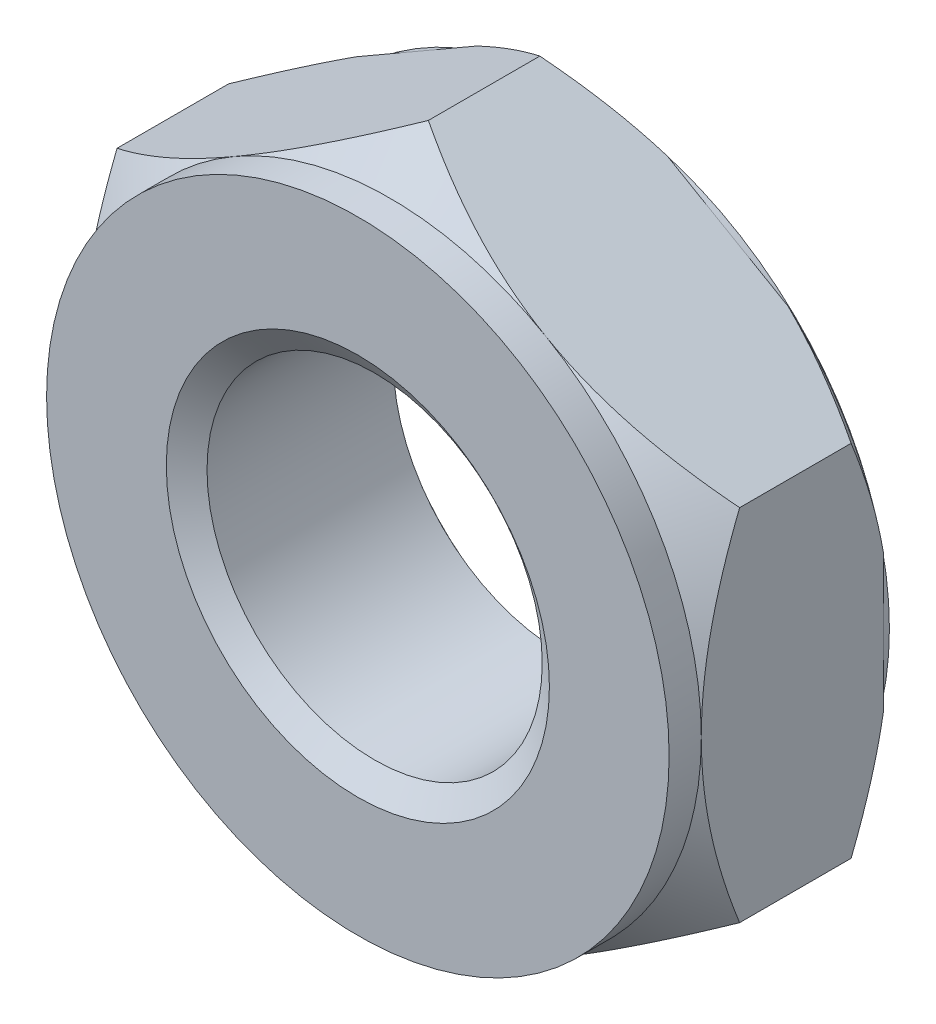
from build123d import *

# Parameters (mm, degrees)
BASENUT_START = -14.605
BASENUTSKE_R  = 11.1125
BASENUT_DEPTH = 14.605
SKETCH4_W     = 0.4064
SKETCH4_H     = 15.892632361


with BuildPart() as part:
    # BaseNutSke → BaseNut (new body)
    with BuildSketch(Plane.XY.offset(BASENUT_START)):
        Polygon((20.6375, 11.91506618), (20.6375, -11.91506618), (0, -23.830132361), (-20.6375, -11.91506618), (-20.6375, 11.91506618), (0, 23.830132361), align=None)
        Circle(BASENUTSKE_R, mode=Mode.SUBTRACT)
    extrude(amount=BASENUT_DEPTH)

    # Sketch4 → Bearing-Face (revolve, cut)
    with BuildSketch(Plane(origin=(0, 0, 0), x_dir=(0, 0, -1), z_dir=(1, 0, 0)), mode=Mode.PRIVATE) as bearing_face_sk:
        with Locations((14.4018, 28.583816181)):
            Rectangle(SKETCH4_W, SKETCH4_H)
        Polygon((0, 20.6375), (-12.7, 20.6375), (-12.7, 36.530132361), (2.54, 36.530132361), (2.54, 23.830132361), align=None)
    revolve(bearing_face_sk.sketch.rotate(Axis((0, 0, 0), (0, 0, -1)), 90), axis=Axis((0, 0, 0), (0, 0, -1)), mode=Mode.SUBTRACT)

    # Sketch3 → Double-Chamfer (revolve, cut)
    with BuildSketch(Plane(origin=(0, 0, 0), x_dir=(0, 0, -1), z_dir=(1, 0, 0)), mode=Mode.PRIVATE) as double_chamfer_sk:
        Polygon((14.605, 20.6375), (12.065, 23.830132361), (12.065, 36.530132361), (27.305, 36.530132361), (27.305, 20.6375), align=None)
        Polygon((4.6736, 36.530132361), (-10.5664, 36.530132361), (-10.5664, 20.6375), (2.1336, 20.6375), (4.6736, 23.830132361), align=None)
    revolve(double_chamfer_sk.sketch.rotate(Axis((0, 0, 0), (0, 0, -1)), 90), axis=Axis((0, 0, 0), (0, 0, -1)), mode=Mode.SUBTRACT)

    # EndChamferSke → EndChamfer (revolve, cut)
    with BuildSketch(Plane(origin=(0, 0, 0), x_dir=(0, 0, -1), z_dir=(1, 0, 0)), mode=Mode.PRIVATE) as endchamfer_sk:
        Polygon((14.5796, 12.7), (13.356862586, 10.95375), (14.6304, 10.95375), (14.6304, 12.7), align=None)
        Polygon((-0.0508, 12.7), (0, 12.7), (1.222737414, 10.95375), (-0.0508, 10.95375), align=None)
    revolve(endchamfer_sk.sketch.rotate(Axis((0, 0, -25.037505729), (0, 0, -1)), 90), axis=Axis((0, 0, -25.037505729), (0, 0, -1)), mode=Mode.SUBTRACT)


solid = part.part
